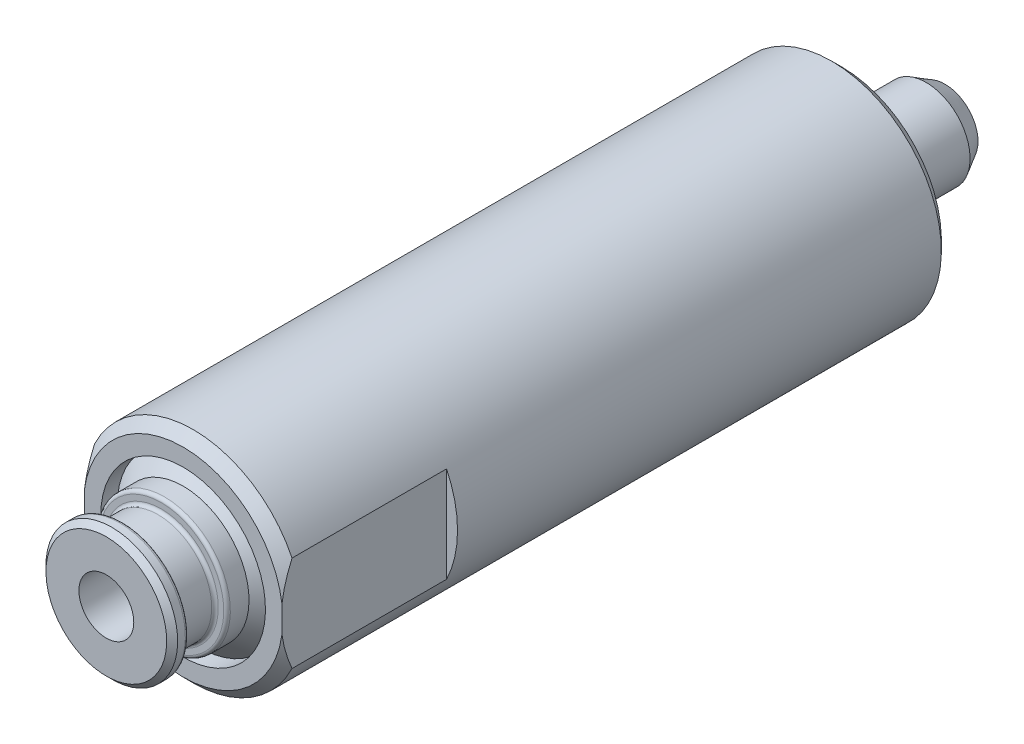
ISO-10303-21;
HEADER;
FILE_DESCRIPTION(('STEP AP214'),'2;1');
FILE_NAME('part.step','',(''),(''),'','','');
FILE_SCHEMA(('AUTOMOTIVE_DESIGN { 1 0 10303 214 1 1 1 1 }'));
ENDSEC;
DATA;
#1=APPLICATION_CONTEXT('core data for automotive mechanical design processes');
#2=APPLICATION_PROTOCOL_DEFINITION('international standard','automotive_design',2000,#1);
#3=PRODUCT_CONTEXT('',#1,'mechanical');
#4=PRODUCT('Part','Part','',(#3));
#5=PRODUCT_RELATED_PRODUCT_CATEGORY('part','',(#4));
#6=PRODUCT_DEFINITION_FORMATION('','',#4);
#7=PRODUCT_DEFINITION_CONTEXT('part definition',#1,'design');
#8=PRODUCT_DEFINITION('design','',#6,#7);
#9=PRODUCT_DEFINITION_SHAPE('','',#8);
#10=(LENGTH_UNIT() NAMED_UNIT(*) SI_UNIT(.MILLI.,.METRE.));
#11=(NAMED_UNIT(*) PLANE_ANGLE_UNIT() SI_UNIT($,.RADIAN.));
#12=(NAMED_UNIT(*) SI_UNIT($,.STERADIAN.) SOLID_ANGLE_UNIT());
#13=UNCERTAINTY_MEASURE_WITH_UNIT(LENGTH_MEASURE(1.E-05),#10,'distance_accuracy_value','');
#14=(GEOMETRIC_REPRESENTATION_CONTEXT(3) GLOBAL_UNCERTAINTY_ASSIGNED_CONTEXT((#13)) GLOBAL_UNIT_ASSIGNED_CONTEXT((#10,
#11,#12)) REPRESENTATION_CONTEXT('',''));
#15=CARTESIAN_POINT('',(0.,0.,0.));
#16=DIRECTION('',(0.,0.,1.));
#17=DIRECTION('',(1.,0.,0.));
#18=AXIS2_PLACEMENT_3D('',#15,#16,#17);
#19=CARTESIAN_POINT('',(0.,0.,-2.));
#20=DIRECTION('',(0.,0.,-1.));
#21=DIRECTION('',(-1.,0.,0.));
#22=AXIS2_PLACEMENT_3D('',#19,#20,#21);
#23=SPHERICAL_SURFACE('',#22,8.);
#24=CARTESIAN_POINT('',(0.,0.,-9.41135340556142));
#25=DIRECTION('',(0.,0.,-1.));
#26=DIRECTION('',(0.,1.,0.));
#27=AXIS2_PLACEMENT_3D('',#24,#25,#26);
#28=CIRCLE('',#27,3.01194965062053);
#29=CARTESIAN_POINT('',(0.,3.01194965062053,-9.41135340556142));
#30=VERTEX_POINT('',#29);
#31=EDGE_CURVE('E9',#30,#30,#28,.T.);
#32=ORIENTED_EDGE('',*,*,#31,.T.);
#33=EDGE_LOOP('',(#32));
#34=FACE_BOUND('',#33,.T.);
#35=ADVANCED_FACE('F14',(#34),#23,.T.);
#36=CARTESIAN_POINT('',(0.,0.,-7.7));
#37=DIRECTION('',(0.,0.,1.));
#38=DIRECTION('',(0.,-1.,0.));
#39=AXIS2_PLACEMENT_3D('',#36,#37,#38);
#40=CONICAL_SURFACE('',#39,4.,0.523598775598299);
#41=ORIENTED_EDGE('',*,*,#31,.F.);
#42=EDGE_LOOP('',(#41));
#43=FACE_BOUND('',#42,.T.);
#44=CARTESIAN_POINT('',(0.,0.,-7.7));
#45=DIRECTION('',(0.,0.,1.));
#46=DIRECTION('',(0.,-1.,0.));
#47=AXIS2_PLACEMENT_3D('',#44,#45,#46);
#48=CIRCLE('',#47,4.);
#49=CARTESIAN_POINT('',(0.,-4.,-7.7));
#50=VERTEX_POINT('',#49);
#51=EDGE_CURVE('E108',#50,#50,#48,.T.);
#52=ORIENTED_EDGE('',*,*,#51,.F.);
#53=EDGE_LOOP('',(#52));
#54=FACE_BOUND('',#53,.T.);
#55=ADVANCED_FACE('F232',(#43,#54),#40,.T.);
#56=CARTESIAN_POINT('',(0.,0.,0.));
#57=DIRECTION('',(0.,0.,-1.));
#58=DIRECTION('',(0.,1.,0.));
#59=AXIS2_PLACEMENT_3D('',#56,#57,#58);
#60=CYLINDRICAL_SURFACE('',#59,4.);
#61=CARTESIAN_POINT('',(0.,0.,0.));
#62=DIRECTION('',(0.,0.,1.));
#63=DIRECTION('',(0.,-1.,0.));
#64=AXIS2_PLACEMENT_3D('',#61,#62,#63);
#65=CIRCLE('',#64,4.);
#66=CARTESIAN_POINT('',(0.,-4.,0.));
#67=VERTEX_POINT('',#66);
#68=EDGE_CURVE('E23',#67,#67,#65,.T.);
#69=ORIENTED_EDGE('',*,*,#68,.F.);
#70=EDGE_LOOP('',(#69));
#71=FACE_BOUND('',#70,.T.);
#72=ORIENTED_EDGE('',*,*,#51,.T.);
#73=EDGE_LOOP('',(#72));
#74=FACE_BOUND('',#73,.T.);
#75=ADVANCED_FACE('F221',(#71,#74),#60,.T.);
#76=CARTESIAN_POINT('',(2.067,0.,67.));
#77=DIRECTION('',(0.,0.,-1.));
#78=DIRECTION('',(0.,1.,0.));
#79=AXIS2_PLACEMENT_3D('',#76,#77,#78);
#80=PLANE('',#79);
#81=CARTESIAN_POINT('',(0.,0.,67.));
#82=DIRECTION('',(0.,0.,1.));
#83=DIRECTION('',(1.,0.,0.));
#84=AXIS2_PLACEMENT_3D('',#81,#82,#83);
#85=CIRCLE('',#84,2.5);
#86=CARTESIAN_POINT('',(2.5,0.,67.));
#87=VERTEX_POINT('',#86);
#88=EDGE_CURVE('E251',#87,#87,#85,.T.);
#89=ORIENTED_EDGE('',*,*,#88,.F.);
#90=EDGE_LOOP('',(#89));
#91=FACE_BOUND('',#90,.T.);
#92=CARTESIAN_POINT('',(0.,0.,67.));
#93=DIRECTION('',(0.,0.,-1.));
#94=DIRECTION('',(0.,1.,0.));
#95=AXIS2_PLACEMENT_3D('',#92,#93,#94);
#96=CIRCLE('',#95,5.5);
#97=CARTESIAN_POINT('',(0.,5.5,67.));
#98=VERTEX_POINT('',#97);
#99=EDGE_CURVE('E153',#98,#98,#96,.T.);
#100=ORIENTED_EDGE('',*,*,#99,.F.);
#101=EDGE_LOOP('',(#100));
#102=FACE_BOUND('',#101,.T.);
#103=ADVANCED_FACE('F211',(#91,#102),#80,.F.);
#104=CARTESIAN_POINT('',(0.,0.,67.));
#105=DIRECTION('',(0.,0.,-1.));
#106=DIRECTION('',(0.,1.,0.));
#107=AXIS2_PLACEMENT_3D('',#104,#105,#106);
#108=CONICAL_SURFACE('',#107,5.5,0.785398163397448);
#109=CARTESIAN_POINT('',(0.,0.,66.5));
#110=DIRECTION('',(0.,0.,-1.));
#111=DIRECTION('',(0.,1.,0.));
#112=AXIS2_PLACEMENT_3D('',#109,#110,#111);
#113=CIRCLE('',#112,6.);
#114=CARTESIAN_POINT('',(0.,6.,66.5));
#115=VERTEX_POINT('',#114);
#116=EDGE_CURVE('E150',#115,#115,#113,.T.);
#117=ORIENTED_EDGE('',*,*,#116,.F.);
#118=EDGE_LOOP('',(#117));
#119=FACE_BOUND('',#118,.T.);
#120=ORIENTED_EDGE('',*,*,#99,.T.);
#121=EDGE_LOOP('',(#120));
#122=FACE_BOUND('',#121,.T.);
#123=ADVANCED_FACE('F220',(#119,#122),#108,.T.);
#124=CARTESIAN_POINT('',(0.,0.,44.5));
#125=DIRECTION('',(0.,0.,-1.));
#126=DIRECTION('',(0.,1.,0.));
#127=AXIS2_PLACEMENT_3D('',#124,#125,#126);
#128=CYLINDRICAL_SURFACE('',#127,6.);
#129=CARTESIAN_POINT('',(0.,0.,65.8));
#130=DIRECTION('',(0.,0.,-1.));
#131=DIRECTION('',(0.,1.,0.));
#132=AXIS2_PLACEMENT_3D('',#129,#130,#131);
#133=CIRCLE('',#132,6.);
#134=CARTESIAN_POINT('',(0.,6.,65.8));
#135=VERTEX_POINT('',#134);
#136=EDGE_CURVE('E147',#135,#135,#133,.T.);
#137=ORIENTED_EDGE('',*,*,#136,.F.);
#138=EDGE_LOOP('',(#137));
#139=FACE_BOUND('',#138,.T.);
#140=ORIENTED_EDGE('',*,*,#116,.T.);
#141=EDGE_LOOP('',(#140));
#142=FACE_BOUND('',#141,.T.);
#143=ADVANCED_FACE('F229',(#139,#142),#128,.T.);
#144=CARTESIAN_POINT('',(0.,0.,65.8));
#145=DIRECTION('',(0.,0.,-1.));
#146=DIRECTION('',(0.,1.,0.));
#147=AXIS2_PLACEMENT_3D('',#144,#145,#146);
#148=TOROIDAL_SURFACE('',#147,5.7,0.300000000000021);
#149=ORIENTED_EDGE('',*,*,#136,.T.);
#150=EDGE_LOOP('',(#149));
#151=FACE_BOUND('',#150,.T.);
#152=CARTESIAN_POINT('',(0.,0.,65.5));
#153=DIRECTION('',(0.,0.,-1.));
#154=DIRECTION('',(0.,1.,0.));
#155=AXIS2_PLACEMENT_3D('',#152,#153,#154);
#156=CIRCLE('',#155,5.7);
#157=CARTESIAN_POINT('',(0.,5.7,65.5));
#158=VERTEX_POINT('',#157);
#159=EDGE_CURVE('E144',#158,#158,#156,.T.);
#160=ORIENTED_EDGE('',*,*,#159,.F.);
#161=EDGE_LOOP('',(#160));
#162=FACE_BOUND('',#161,.T.);
#163=ADVANCED_FACE('F297',(#151,#162),#148,.T.);
#164=CARTESIAN_POINT('',(5.7,0.,65.5));
#165=DIRECTION('',(0.,0.,1.));
#166=DIRECTION('',(0.,-1.,0.));
#167=AXIS2_PLACEMENT_3D('',#164,#165,#166);
#168=PLANE('',#167);
#169=CARTESIAN_POINT('',(0.,0.,65.5));
#170=DIRECTION('',(0.,0.,-1.));
#171=DIRECTION('',(0.,1.,0.));
#172=AXIS2_PLACEMENT_3D('',#169,#170,#171);
#173=CIRCLE('',#172,5.2);
#174=CARTESIAN_POINT('',(0.,5.2,65.5));
#175=VERTEX_POINT('',#174);
#176=EDGE_CURVE('E141',#175,#175,#173,.T.);
#177=ORIENTED_EDGE('',*,*,#176,.F.);
#178=EDGE_LOOP('',(#177));
#179=FACE_BOUND('',#178,.T.);
#180=ORIENTED_EDGE('',*,*,#159,.T.);
#181=EDGE_LOOP('',(#180));
#182=FACE_BOUND('',#181,.T.);
#183=ADVANCED_FACE('F293',(#179,#182),#168,.F.);
#184=CARTESIAN_POINT('',(0.,0.,65.2));
#185=DIRECTION('',(0.,0.,-1.));
#186=DIRECTION('',(0.,1.,0.));
#187=AXIS2_PLACEMENT_3D('',#184,#185,#186);
#188=TOROIDAL_SURFACE('',#187,5.2,0.300000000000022);
#189=CARTESIAN_POINT('',(0.,0.,65.2));
#190=DIRECTION('',(0.,0.,-1.));
#191=DIRECTION('',(0.,1.,0.));
#192=AXIS2_PLACEMENT_3D('',#189,#190,#191);
#193=CIRCLE('',#192,4.9);
#194=CARTESIAN_POINT('',(0.,4.9,65.2));
#195=VERTEX_POINT('',#194);
#196=EDGE_CURVE('E138',#195,#195,#193,.T.);
#197=ORIENTED_EDGE('',*,*,#196,.F.);
#198=EDGE_LOOP('',(#197));
#199=FACE_BOUND('',#198,.T.);
#200=ORIENTED_EDGE('',*,*,#176,.T.);
#201=EDGE_LOOP('',(#200));
#202=FACE_BOUND('',#201,.T.);
#203=ADVANCED_FACE('F289',(#199,#202),#188,.F.);
#204=CARTESIAN_POINT('',(0.,0.,44.5));
#205=DIRECTION('',(0.,0.,-1.));
#206=DIRECTION('',(0.,1.,0.));
#207=AXIS2_PLACEMENT_3D('',#204,#205,#206);
#208=CYLINDRICAL_SURFACE('',#207,4.9);
#209=CARTESIAN_POINT('',(0.,0.,62.3));
#210=DIRECTION('',(0.,0.,-1.));
#211=DIRECTION('',(0.,1.,0.));
#212=AXIS2_PLACEMENT_3D('',#209,#210,#211);
#213=CIRCLE('',#212,4.9);
#214=CARTESIAN_POINT('',(0.,4.9,62.3));
#215=VERTEX_POINT('',#214);
#216=EDGE_CURVE('E135',#215,#215,#213,.T.);
#217=ORIENTED_EDGE('',*,*,#216,.F.);
#218=EDGE_LOOP('',(#217));
#219=FACE_BOUND('',#218,.T.);
#220=ORIENTED_EDGE('',*,*,#196,.T.);
#221=EDGE_LOOP('',(#220));
#222=FACE_BOUND('',#221,.T.);
#223=ADVANCED_FACE('F285',(#219,#222),#208,.T.);
#224=CARTESIAN_POINT('',(0.,0.,62.3));
#225=DIRECTION('',(0.,0.,-1.));
#226=DIRECTION('',(0.,1.,0.));
#227=AXIS2_PLACEMENT_3D('',#224,#225,#226);
#228=TOROIDAL_SURFACE('',#227,5.2,0.299999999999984);
#229=CARTESIAN_POINT('',(0.,0.,62.));
#230=DIRECTION('',(0.,0.,-1.));
#231=DIRECTION('',(0.,1.,0.));
#232=AXIS2_PLACEMENT_3D('',#229,#230,#231);
#233=CIRCLE('',#232,5.2);
#234=CARTESIAN_POINT('',(0.,5.2,62.));
#235=VERTEX_POINT('',#234);
#236=EDGE_CURVE('E132',#235,#235,#233,.T.);
#237=ORIENTED_EDGE('',*,*,#236,.F.);
#238=EDGE_LOOP('',(#237));
#239=FACE_BOUND('',#238,.T.);
#240=ORIENTED_EDGE('',*,*,#216,.T.);
#241=EDGE_LOOP('',(#240));
#242=FACE_BOUND('',#241,.T.);
#243=ADVANCED_FACE('F281',(#239,#242),#228,.F.);
#244=CARTESIAN_POINT('',(5.2,0.,62.));
#245=DIRECTION('',(0.,0.,-1.));
#246=DIRECTION('',(0.,1.,0.));
#247=AXIS2_PLACEMENT_3D('',#244,#245,#246);
#248=PLANE('',#247);
#249=CARTESIAN_POINT('',(0.,0.,62.));
#250=DIRECTION('',(0.,0.,-1.));
#251=DIRECTION('',(0.,1.,0.));
#252=AXIS2_PLACEMENT_3D('',#249,#250,#251);
#253=CIRCLE('',#252,5.7);
#254=CARTESIAN_POINT('',(0.,5.7,62.));
#255=VERTEX_POINT('',#254);
#256=EDGE_CURVE('E129',#255,#255,#253,.T.);
#257=ORIENTED_EDGE('',*,*,#256,.F.);
#258=EDGE_LOOP('',(#257));
#259=FACE_BOUND('',#258,.T.);
#260=ORIENTED_EDGE('',*,*,#236,.T.);
#261=EDGE_LOOP('',(#260));
#262=FACE_BOUND('',#261,.T.);
#263=ADVANCED_FACE('F277',(#259,#262),#248,.F.);
#264=CARTESIAN_POINT('',(0.,0.,61.7));
#265=DIRECTION('',(0.,0.,-1.));
#266=DIRECTION('',(0.,1.,0.));
#267=AXIS2_PLACEMENT_3D('',#264,#265,#266);
#268=TOROIDAL_SURFACE('',#267,5.7,0.299999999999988);
#269=ORIENTED_EDGE('',*,*,#256,.T.);
#270=EDGE_LOOP('',(#269));
#271=FACE_BOUND('',#270,.T.);
#272=CARTESIAN_POINT('',(0.,0.,61.7));
#273=DIRECTION('',(0.,0.,-1.));
#274=DIRECTION('',(0.,1.,0.));
#275=AXIS2_PLACEMENT_3D('',#272,#273,#274);
#276=CIRCLE('',#275,6.);
#277=CARTESIAN_POINT('',(0.,6.,61.7));
#278=VERTEX_POINT('',#277);
#279=EDGE_CURVE('E126',#278,#278,#276,.T.);
#280=ORIENTED_EDGE('',*,*,#279,.F.);
#281=EDGE_LOOP('',(#280));
#282=FACE_BOUND('',#281,.T.);
#283=ADVANCED_FACE('F273',(#271,#282),#268,.T.);
#284=CARTESIAN_POINT('',(0.,0.,44.5));
#285=DIRECTION('',(0.,0.,-1.));
#286=DIRECTION('',(0.,1.,0.));
#287=AXIS2_PLACEMENT_3D('',#284,#285,#286);
#288=CYLINDRICAL_SURFACE('',#287,6.);
#289=CARTESIAN_POINT('',(0.,0.,60.));
#290=DIRECTION('',(0.,0.,-1.));
#291=DIRECTION('',(0.,1.,0.));
#292=AXIS2_PLACEMENT_3D('',#289,#290,#291);
#293=CIRCLE('',#292,6.);
#294=CARTESIAN_POINT('',(0.,6.,60.));
#295=VERTEX_POINT('',#294);
#296=EDGE_CURVE('E122',#295,#295,#293,.T.);
#297=ORIENTED_EDGE('',*,*,#296,.F.);
#298=EDGE_LOOP('',(#297));
#299=FACE_BOUND('',#298,.T.);
#300=ORIENTED_EDGE('',*,*,#279,.T.);
#301=EDGE_LOOP('',(#300));
#302=FACE_BOUND('',#301,.T.);
#303=ADVANCED_FACE('F269',(#299,#302),#288,.T.);
#304=CARTESIAN_POINT('',(0.,0.,60.));
#305=DIRECTION('',(0.,0.,-1.));
#306=DIRECTION('',(0.,1.,0.));
#307=AXIS2_PLACEMENT_3D('',#304,#305,#306);
#308=CONICAL_SURFACE('',#307,6.,0.78539816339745);
#309=CARTESIAN_POINT('',(0.,0.,58.5));
#310=DIRECTION('',(0.,0.,-1.));
#311=DIRECTION('',(0.,1.,0.));
#312=AXIS2_PLACEMENT_3D('',#309,#310,#311);
#313=CIRCLE('',#312,7.5);
#314=CARTESIAN_POINT('',(0.,7.5,58.5));
#315=VERTEX_POINT('',#314);
#316=EDGE_CURVE('E119',#315,#315,#313,.T.);
#317=ORIENTED_EDGE('',*,*,#316,.F.);
#318=EDGE_LOOP('',(#317));
#319=FACE_BOUND('',#318,.T.);
#320=ORIENTED_EDGE('',*,*,#296,.T.);
#321=EDGE_LOOP('',(#320));
#322=FACE_BOUND('',#321,.T.);
#323=ADVANCED_FACE('F183',(#319,#322),#308,.T.);
#324=CARTESIAN_POINT('',(0.,0.,0.));
#325=DIRECTION('',(0.,0.,-1.));
#326=DIRECTION('',(0.,1.,0.));
#327=AXIS2_PLACEMENT_3D('',#324,#325,#326);
#328=CYLINDRICAL_SURFACE('',#327,7.5);
#329=ORIENTED_EDGE('',*,*,#316,.T.);
#330=EDGE_LOOP('',(#329));
#331=FACE_BOUND('',#330,.T.);
#332=CARTESIAN_POINT('',(0.,0.,60.));
#333=DIRECTION('',(0.,0.,-1.));
#334=DIRECTION('',(0.,1.,0.));
#335=AXIS2_PLACEMENT_3D('',#332,#333,#334);
#336=CIRCLE('',#335,7.5);
#337=CARTESIAN_POINT('',(0.,7.5,60.));
#338=VERTEX_POINT('',#337);
#339=EDGE_CURVE('E95',#338,#338,#336,.T.);
#340=ORIENTED_EDGE('',*,*,#339,.F.);
#341=EDGE_LOOP('',(#340));
#342=FACE_BOUND('',#341,.T.);
#343=ADVANCED_FACE('F181',(#331,#342),#328,.F.);
#344=CARTESIAN_POINT('',(9.08,0.,60.));
#345=DIRECTION('',(0.,0.,1.));
#346=DIRECTION('',(0.,-1.,0.));
#347=AXIS2_PLACEMENT_3D('',#344,#345,#346);
#348=PLANE('',#347);
#349=ORIENTED_EDGE('',*,*,#339,.T.);
#350=EDGE_LOOP('',(#349));
#351=FACE_BOUND('',#350,.T.);
#352=CARTESIAN_POINT('',(0.,0.,60.));
#353=DIRECTION('',(0.,0.,-1.));
#354=DIRECTION('',(0.,1.,0.));
#355=AXIS2_PLACEMENT_3D('',#352,#353,#354);
#356=CIRCLE('',#355,9.08);
#357=CARTESIAN_POINT('',(-9.,1.20266371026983,60.));
#358=VERTEX_POINT('',#357);
#359=CARTESIAN_POINT('',(9.,1.20266371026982,60.));
#360=VERTEX_POINT('',#359);
#361=EDGE_CURVE('E92',#358,#360,#356,.T.);
#362=ORIENTED_EDGE('',*,*,#361,.F.);
#363=DIRECTION('',(0.,-1.,0.));
#364=VECTOR('',#363,1.);
#365=CARTESIAN_POINT('',(-9.,0.,60.));
#366=LINE('',#365,#364);
#367=CARTESIAN_POINT('',(-9.,-1.20266371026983,60.));
#368=VERTEX_POINT('',#367);
#369=EDGE_CURVE('E78',#358,#368,#366,.T.);
#370=ORIENTED_EDGE('',*,*,#369,.T.);
#371=CARTESIAN_POINT('',(9.,-1.20266371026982,60.));
#372=VERTEX_POINT('',#371);
#373=EDGE_CURVE('E85',#372,#368,#356,.T.);
#374=ORIENTED_EDGE('',*,*,#373,.F.);
#375=DIRECTION('',(0.,1.,0.));
#376=VECTOR('',#375,1.);
#377=CARTESIAN_POINT('',(9.,0.,60.));
#378=LINE('',#377,#376);
#379=EDGE_CURVE('E68',#372,#360,#378,.T.);
#380=ORIENTED_EDGE('',*,*,#379,.T.);
#381=EDGE_LOOP('',(#362,#370,#374,#380));
#382=FACE_BOUND('',#381,.T.);
#383=ADVANCED_FACE('F90',(#351,#382),#348,.T.);
#384=CARTESIAN_POINT('',(0.,0.,59.08));
#385=DIRECTION('',(0.,0.,-1.));
#386=DIRECTION('',(0.,1.,0.));
#387=AXIS2_PLACEMENT_3D('',#384,#385,#386);
#388=CONICAL_SURFACE('',#387,10.,0.78539816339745);
#389=CARTESIAN_POINT('',(0.,0.,59.08));
#390=DIRECTION('',(0.,0.,-1.));
#391=DIRECTION('',(0.,1.,0.));
#392=AXIS2_PLACEMENT_3D('',#389,#390,#391);
#393=CIRCLE('',#392,10.);
#394=CARTESIAN_POINT('',(-9.,4.35889894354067,59.08));
#395=VERTEX_POINT('',#394);
#396=CARTESIAN_POINT('',(9.,4.35889894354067,59.08));
#397=VERTEX_POINT('',#396);
#398=EDGE_CURVE('E91',#395,#397,#393,.T.);
#399=ORIENTED_EDGE('',*,*,#398,.F.);
#400=CARTESIAN_POINT('',(-9.,20.0889844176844,47.0671107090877));
#401=CARTESIAN_POINT('',(-9.,19.7941845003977,47.3361376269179));
#402=CARTESIAN_POINT('',(-9.,19.4988987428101,47.6046332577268));
#403=CARTESIAN_POINT('',(-9.,18.9072134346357,48.1403994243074));
#404=CARTESIAN_POINT('',(-9.,18.6108138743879,48.4076699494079));
#405=CARTESIAN_POINT('',(-9.,18.0166892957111,48.9408857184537));
#406=CARTESIAN_POINT('',(-9.,17.7189639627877,49.2068306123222));
#407=CARTESIAN_POINT('',(-9.,17.1220890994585,49.7371142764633));
#408=CARTESIAN_POINT('',(-9.,16.822939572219,50.0014530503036));
#409=CARTESIAN_POINT('',(-9.,15.9186985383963,50.7955547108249));
#410=CARTESIAN_POINT('',(-9.,15.3111326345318,51.3225158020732));
#411=CARTESIAN_POINT('',(-9.,14.3932925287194,52.1052669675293));
#412=CARTESIAN_POINT('',(-9.,14.0862824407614,52.3648870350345));
#413=CARTESIAN_POINT('',(-9.,13.4697157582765,52.8810880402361));
#414=CARTESIAN_POINT('',(-9.,13.1601591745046,53.137668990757));
#415=CARTESIAN_POINT('',(-9.,12.5849192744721,53.6088254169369));
#416=CARTESIAN_POINT('',(-9.,12.3196505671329,53.8239068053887));
#417=CARTESIAN_POINT('',(-9.,11.7866455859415,54.2509886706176));
#418=CARTESIAN_POINT('',(-9.,11.5189093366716,54.4629891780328));
#419=CARTESIAN_POINT('',(-9.,10.9804995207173,54.883413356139));
#420=CARTESIAN_POINT('',(-9.,10.7098250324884,55.0918358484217));
#421=CARTESIAN_POINT('',(-9.,10.1651714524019,55.5043204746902));
#422=CARTESIAN_POINT('',(-9.,9.89119239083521,55.7083826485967));
#423=CARTESIAN_POINT('',(-9.,9.33978293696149,56.1109565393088));
#424=CARTESIAN_POINT('',(-9.,9.06235809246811,56.3094758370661));
#425=CARTESIAN_POINT('',(-9.,8.50301529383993,56.7001296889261));
#426=CARTESIAN_POINT('',(-9.,8.22109712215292,56.8922639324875));
#427=CARTESIAN_POINT('',(-9.,7.65217834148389,57.2685512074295));
#428=CARTESIAN_POINT('',(-9.,7.36518050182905,57.4527084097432));
#429=CARTESIAN_POINT('',(-9.,6.78513344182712,57.8111918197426));
#430=CARTESIAN_POINT('',(-9.,6.49208508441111,57.9855194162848));
#431=CARTESIAN_POINT('',(-9.,5.90679788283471,58.317393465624));
#432=CARTESIAN_POINT('',(-9.,5.61474269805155,58.4752618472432));
#433=CARTESIAN_POINT('',(-9.,5.02305416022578,58.7763015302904));
#434=CARTESIAN_POINT('',(-9.,4.72342010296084,58.9194714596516));
#435=CARTESIAN_POINT('',(-9.,4.11636189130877,59.1870563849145));
#436=CARTESIAN_POINT('',(-9.,3.80895049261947,59.3115000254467));
#437=CARTESIAN_POINT('',(-9.,3.18569208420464,59.5372331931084));
#438=CARTESIAN_POINT('',(-9.,2.86984745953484,59.6385291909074));
#439=CARTESIAN_POINT('',(-9.,2.29142781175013,59.7962123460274));
#440=CARTESIAN_POINT('',(-9.,2.03019136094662,59.8574808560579));
#441=CARTESIAN_POINT('',(-9.,1.5036267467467,59.958913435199));
#442=CARTESIAN_POINT('',(-9.,1.23829917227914,59.9990805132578));
#443=CARTESIAN_POINT('',(-9.,0.705706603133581,60.0562472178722));
#444=CARTESIAN_POINT('',(-9.,0.438447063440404,60.0732969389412));
#445=CARTESIAN_POINT('',(-9.,-0.0965355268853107,60.0834560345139));
#446=CARTESIAN_POINT('',(-9.,-0.364258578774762,60.076565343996));
#447=CARTESIAN_POINT('',(-9.,-0.89754729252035,60.0392623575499));
#448=CARTESIAN_POINT('',(-9.,-1.1631159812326,60.0088926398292));
#449=CARTESIAN_POINT('',(-9.,-1.69079838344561,59.9262664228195));
#450=CARTESIAN_POINT('',(-9.,-1.95291180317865,59.8740080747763));
#451=CARTESIAN_POINT('',(-9.,-2.47314253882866,59.7498122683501));
#452=CARTESIAN_POINT('',(-9.,-2.73124679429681,59.6778207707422));
#453=CARTESIAN_POINT('',(-9.,-3.24205693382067,59.516938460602));
#454=CARTESIAN_POINT('',(-9.,-3.49476303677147,59.4280483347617));
#455=CARTESIAN_POINT('',(-9.,-4.07604409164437,59.2047542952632));
#456=CARTESIAN_POINT('',(-9.,-4.40253716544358,59.0649539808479));
#457=CARTESIAN_POINT('',(-9.,-5.0464515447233,58.7656734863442));
#458=CARTESIAN_POINT('',(-9.,-5.36386785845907,58.6061827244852));
#459=CARTESIAN_POINT('',(-9.,-5.99110227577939,58.2715395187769));
#460=CARTESIAN_POINT('',(-9.,-6.30090358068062,58.0963558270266));
#461=CARTESIAN_POINT('',(-9.,-6.91327229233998,57.7339678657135));
#462=CARTESIAN_POINT('',(-9.,-7.21584094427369,57.5467656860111));
#463=CARTESIAN_POINT('',(-9.,-7.81811190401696,57.160734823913));
#464=CARTESIAN_POINT('',(-9.,-8.11774682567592,56.9618014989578));
#465=CARTESIAN_POINT('',(-9.,-8.71169811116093,56.5561568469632));
#466=CARTESIAN_POINT('',(-9.,-9.00601430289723,56.3494452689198));
#467=CARTESIAN_POINT('',(-9.,-9.58977868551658,55.9299922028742));
#468=CARTESIAN_POINT('',(-9.,-9.87923221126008,55.717258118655));
#469=CARTESIAN_POINT('',(-9.,-10.4543036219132,55.2866619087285));
#470=CARTESIAN_POINT('',(-9.,-10.7399213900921,55.0687996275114));
#471=CARTESIAN_POINT('',(-9.,-11.4242974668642,54.5386678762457));
#472=CARTESIAN_POINT('',(-9.,-11.8214368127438,54.2243100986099));
#473=CARTESIAN_POINT('',(-9.,-12.6104586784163,53.5890670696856));
#474=CARTESIAN_POINT('',(-9.,-13.0023410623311,53.2681816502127));
#475=CARTESIAN_POINT('',(-9.,-13.7819938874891,52.6210793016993));
#476=CARTESIAN_POINT('',(-9.,-14.1697622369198,52.2948598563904));
#477=CARTESIAN_POINT('',(-9.,-14.9417496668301,51.6382482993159));
#478=CARTESIAN_POINT('',(-9.,-15.3259687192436,51.3078561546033));
#479=CARTESIAN_POINT('',(-9.,-16.0783900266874,50.6549933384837));
#480=CARTESIAN_POINT('',(-9.,-16.44669153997,50.3326369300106));
#481=CARTESIAN_POINT('',(-9.,-17.1809601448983,49.6852740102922));
#482=CARTESIAN_POINT('',(-9.,-17.5469272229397,49.3602674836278));
#483=CARTESIAN_POINT('',(-9.,-18.276556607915,48.7083120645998));
#484=CARTESIAN_POINT('',(-9.,-18.640220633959,48.3813650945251));
#485=CARTESIAN_POINT('',(-9.,-19.3658255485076,47.725578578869));
#486=CARTESIAN_POINT('',(-9.,-19.727766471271,47.3967390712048));
#487=CARTESIAN_POINT('',(-9.,-20.0889844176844,47.0671107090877));
#488=B_SPLINE_CURVE_WITH_KNOTS('',3,(#400,#401,#402,#403,#404,#405,#406,#407,#408,#409,#410,
#411,#412,#413,#414,#415,#416,#417,#418,#419,#420,#421,#422,#423,#424,#425,#426,#427,#428,#429,
#430,#431,#432,#433,#434,#435,#436,#437,#438,#439,#440,#441,#442,#443,#444,#445,#446,#447,#448,
#449,#450,#451,#452,#453,#454,#455,#456,#457,#458,#459,#460,#461,#462,#463,#464,#465,#466,#467,
#468,#469,#470,#471,#472,#473,#474,#475,#476,#477,#478,#479,#480,#481,#482,#483,#484,#485,#486,
#487),.UNSPECIFIED.,.F.,.F.,(4,2,2,2,2,2,2,2,2,2,2,2,2,2,2,2,2,2,2,2,2,2,2,2,2,2,2,2,2,2,2,2,2,
2,2,2,2,2,2,2,2,2,2,4),(0.,1.19730659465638,2.39462359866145,3.59224161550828,4.78985697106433,
7.20251667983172,8.40870278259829,9.61488379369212,10.639387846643,11.663881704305,
12.6887067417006,13.7135223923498,14.7368599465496,15.7602471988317,16.7830927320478,
17.8057933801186,18.8014398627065,19.7971792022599,20.7913795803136,21.7853016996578,
22.5895213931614,23.3936263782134,24.1959860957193,24.9983479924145,25.7992582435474,
26.6002361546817,27.4034298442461,28.206590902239,29.2712072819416,30.3363983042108,
31.4037596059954,32.47093580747,33.5497661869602,34.6286314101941,35.70622346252,
36.7838482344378,38.303247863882,39.8226866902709,41.3428642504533,42.8630538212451,
44.3313839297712,45.7997225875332,47.2667917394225,48.7338316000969),.UNSPECIFIED.);
#489=EDGE_CURVE('E198',#395,#358,#488,.T.);
#490=ORIENTED_EDGE('',*,*,#489,.T.);
#491=ORIENTED_EDGE('',*,*,#361,.T.);
#492=CARTESIAN_POINT('',(9.,-20.0889844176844,47.0671107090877));
#493=CARTESIAN_POINT('',(9.,-19.7941845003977,47.3361376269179));
#494=CARTESIAN_POINT('',(9.,-19.4988987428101,47.6046332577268));
#495=CARTESIAN_POINT('',(9.,-18.9072134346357,48.1403994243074));
#496=CARTESIAN_POINT('',(9.,-18.6108138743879,48.4076699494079));
#497=CARTESIAN_POINT('',(9.,-18.0166892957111,48.9408857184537));
#498=CARTESIAN_POINT('',(9.,-17.7189639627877,49.2068306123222));
#499=CARTESIAN_POINT('',(9.,-17.1220890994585,49.7371142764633));
#500=CARTESIAN_POINT('',(9.,-16.822939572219,50.0014530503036));
#501=CARTESIAN_POINT('',(9.,-15.9186985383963,50.7955547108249));
#502=CARTESIAN_POINT('',(9.,-15.3111326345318,51.3225158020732));
#503=CARTESIAN_POINT('',(9.,-14.3932925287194,52.1052669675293));
#504=CARTESIAN_POINT('',(9.,-14.0862824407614,52.3648870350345));
#505=CARTESIAN_POINT('',(9.,-13.4697157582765,52.8810880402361));
#506=CARTESIAN_POINT('',(9.,-13.1601591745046,53.137668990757));
#507=CARTESIAN_POINT('',(9.,-12.5849192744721,53.6088254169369));
#508=CARTESIAN_POINT('',(9.,-12.3196505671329,53.8239068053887));
#509=CARTESIAN_POINT('',(9.,-11.7866455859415,54.2509886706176));
#510=CARTESIAN_POINT('',(9.,-11.5189093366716,54.4629891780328));
#511=CARTESIAN_POINT('',(9.,-10.9804995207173,54.883413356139));
#512=CARTESIAN_POINT('',(9.,-10.7098250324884,55.0918358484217));
#513=CARTESIAN_POINT('',(9.,-10.1651714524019,55.5043204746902));
#514=CARTESIAN_POINT('',(9.,-9.89119239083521,55.7083826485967));
#515=CARTESIAN_POINT('',(9.,-9.33978293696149,56.1109565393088));
#516=CARTESIAN_POINT('',(9.,-9.06235809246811,56.3094758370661));
#517=CARTESIAN_POINT('',(9.,-8.50301529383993,56.7001296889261));
#518=CARTESIAN_POINT('',(9.,-8.22109712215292,56.8922639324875));
#519=CARTESIAN_POINT('',(9.,-7.65217834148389,57.2685512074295));
#520=CARTESIAN_POINT('',(9.,-7.36518050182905,57.4527084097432));
#521=CARTESIAN_POINT('',(9.,-6.78513344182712,57.8111918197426));
#522=CARTESIAN_POINT('',(9.,-6.49208508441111,57.9855194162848));
#523=CARTESIAN_POINT('',(9.,-5.90679788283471,58.317393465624));
#524=CARTESIAN_POINT('',(9.,-5.61474269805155,58.4752618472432));
#525=CARTESIAN_POINT('',(9.,-5.02305416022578,58.7763015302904));
#526=CARTESIAN_POINT('',(9.,-4.72342010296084,58.9194714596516));
#527=CARTESIAN_POINT('',(9.,-4.11636189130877,59.1870563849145));
#528=CARTESIAN_POINT('',(9.,-3.80895049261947,59.3115000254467));
#529=CARTESIAN_POINT('',(9.,-3.18569208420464,59.5372331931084));
#530=CARTESIAN_POINT('',(9.,-2.86984745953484,59.6385291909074));
#531=CARTESIAN_POINT('',(9.,-2.29142781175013,59.7962123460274));
#532=CARTESIAN_POINT('',(9.,-2.03019136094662,59.8574808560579));
#533=CARTESIAN_POINT('',(9.,-1.5036267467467,59.958913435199));
#534=CARTESIAN_POINT('',(9.,-1.23829917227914,59.9990805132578));
#535=CARTESIAN_POINT('',(9.,-0.705706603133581,60.0562472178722));
#536=CARTESIAN_POINT('',(9.,-0.438447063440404,60.0732969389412));
#537=CARTESIAN_POINT('',(9.,0.0965355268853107,60.0834560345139));
#538=CARTESIAN_POINT('',(9.,0.364258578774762,60.076565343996));
#539=CARTESIAN_POINT('',(9.,0.89754729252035,60.0392623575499));
#540=CARTESIAN_POINT('',(9.,1.1631159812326,60.0088926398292));
#541=CARTESIAN_POINT('',(9.,1.69079838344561,59.9262664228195));
#542=CARTESIAN_POINT('',(9.,1.95291180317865,59.8740080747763));
#543=CARTESIAN_POINT('',(9.,2.47314253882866,59.7498122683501));
#544=CARTESIAN_POINT('',(9.,2.73124679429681,59.6778207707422));
#545=CARTESIAN_POINT('',(9.,3.24205693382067,59.516938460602));
#546=CARTESIAN_POINT('',(9.,3.49476303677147,59.4280483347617));
#547=CARTESIAN_POINT('',(9.,4.07604409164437,59.2047542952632));
#548=CARTESIAN_POINT('',(9.,4.40253716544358,59.0649539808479));
#549=CARTESIAN_POINT('',(9.,5.0464515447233,58.7656734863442));
#550=CARTESIAN_POINT('',(9.,5.36386785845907,58.6061827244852));
#551=CARTESIAN_POINT('',(9.,5.99110227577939,58.2715395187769));
#552=CARTESIAN_POINT('',(9.,6.30090358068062,58.0963558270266));
#553=CARTESIAN_POINT('',(9.,6.91327229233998,57.7339678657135));
#554=CARTESIAN_POINT('',(9.,7.21584094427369,57.5467656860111));
#555=CARTESIAN_POINT('',(9.,7.81811190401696,57.160734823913));
#556=CARTESIAN_POINT('',(9.,8.11774682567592,56.9618014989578));
#557=CARTESIAN_POINT('',(9.,8.71169811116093,56.5561568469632));
#558=CARTESIAN_POINT('',(9.,9.00601430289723,56.3494452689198));
#559=CARTESIAN_POINT('',(9.,9.58977868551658,55.9299922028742));
#560=CARTESIAN_POINT('',(9.,9.87923221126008,55.717258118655));
#561=CARTESIAN_POINT('',(9.,10.4543036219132,55.2866619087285));
#562=CARTESIAN_POINT('',(9.,10.7399213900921,55.0687996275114));
#563=CARTESIAN_POINT('',(9.,11.4242974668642,54.5386678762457));
#564=CARTESIAN_POINT('',(9.,11.8214368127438,54.2243100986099));
#565=CARTESIAN_POINT('',(9.,12.6104586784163,53.5890670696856));
#566=CARTESIAN_POINT('',(9.,13.0023410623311,53.2681816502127));
#567=CARTESIAN_POINT('',(9.,13.7819938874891,52.6210793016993));
#568=CARTESIAN_POINT('',(9.,14.1697622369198,52.2948598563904));
#569=CARTESIAN_POINT('',(9.,14.9417496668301,51.6382482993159));
#570=CARTESIAN_POINT('',(9.,15.3259687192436,51.3078561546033));
#571=CARTESIAN_POINT('',(9.,16.0783900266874,50.6549933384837));
#572=CARTESIAN_POINT('',(9.,16.44669153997,50.3326369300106));
#573=CARTESIAN_POINT('',(9.,17.1809601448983,49.6852740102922));
#574=CARTESIAN_POINT('',(9.,17.5469272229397,49.3602674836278));
#575=CARTESIAN_POINT('',(9.,18.276556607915,48.7083120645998));
#576=CARTESIAN_POINT('',(9.,18.640220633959,48.3813650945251));
#577=CARTESIAN_POINT('',(9.,19.3658255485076,47.725578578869));
#578=CARTESIAN_POINT('',(9.,19.727766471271,47.3967390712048));
#579=CARTESIAN_POINT('',(9.,20.0889844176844,47.0671107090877));
#580=B_SPLINE_CURVE_WITH_KNOTS('',3,(#492,#493,#494,#495,#496,#497,#498,#499,#500,#501,#502,
#503,#504,#505,#506,#507,#508,#509,#510,#511,#512,#513,#514,#515,#516,#517,#518,#519,#520,#521,
#522,#523,#524,#525,#526,#527,#528,#529,#530,#531,#532,#533,#534,#535,#536,#537,#538,#539,#540,
#541,#542,#543,#544,#545,#546,#547,#548,#549,#550,#551,#552,#553,#554,#555,#556,#557,#558,#559,
#560,#561,#562,#563,#564,#565,#566,#567,#568,#569,#570,#571,#572,#573,#574,#575,#576,#577,#578,
#579),.UNSPECIFIED.,.F.,.F.,(4,2,2,2,2,2,2,2,2,2,2,2,2,2,2,2,2,2,2,2,2,2,2,2,2,2,2,2,2,2,2,2,2,
2,2,2,2,2,2,2,2,2,2,4),(0.,1.19730659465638,2.39462359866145,3.59224161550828,4.78985697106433,
7.20251667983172,8.40870278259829,9.61488379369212,10.639387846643,11.663881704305,
12.6887067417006,13.7135223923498,14.7368599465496,15.7602471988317,16.7830927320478,
17.8057933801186,18.8014398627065,19.7971792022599,20.7913795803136,21.7853016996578,
22.5895213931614,23.3936263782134,24.1959860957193,24.9983479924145,25.7992582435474,
26.6002361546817,27.4034298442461,28.206590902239,29.2712072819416,30.3363983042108,
31.4037596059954,32.47093580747,33.5497661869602,34.6286314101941,35.70622346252,
36.7838482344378,38.303247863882,39.8226866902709,41.3428642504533,42.8630538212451,
44.3313839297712,45.7997225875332,47.2667917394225,48.7338316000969),.UNSPECIFIED.);
#581=EDGE_CURVE('E31',#360,#397,#580,.T.);
#582=ORIENTED_EDGE('',*,*,#581,.T.);
#583=EDGE_LOOP('',(#399,#490,#491,#582));
#584=FACE_BOUND('',#583,.T.);
#585=ADVANCED_FACE('F168',(#584),#388,.T.);
#586=CARTESIAN_POINT('',(0.,0.,45.));
#587=DIRECTION('',(0.,0.,1.));
#588=DIRECTION('',(0.,-1.,0.));
#589=AXIS2_PLACEMENT_3D('',#586,#587,#588);
#590=PLANE('',#589);
#591=DIRECTION('',(0.,-1.,0.));
#592=VECTOR('',#591,1.);
#593=CARTESIAN_POINT('',(-9.,10.,45.));
#594=LINE('',#593,#592);
#595=CARTESIAN_POINT('',(-9.,4.35889894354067,45.));
#596=VERTEX_POINT('',#595);
#597=CARTESIAN_POINT('',(-9.,-4.35889894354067,45.));
#598=VERTEX_POINT('',#597);
#599=EDGE_CURVE('E158',#596,#598,#594,.T.);
#600=ORIENTED_EDGE('',*,*,#599,.F.);
#601=CARTESIAN_POINT('',(0.,0.,45.));
#602=DIRECTION('',(0.,0.,1.));
#603=DIRECTION('',(0.,-1.,0.));
#604=AXIS2_PLACEMENT_3D('',#601,#602,#603);
#605=CIRCLE('',#604,10.);
#606=EDGE_CURVE('E104',#598,#596,#605,.F.);
#607=ORIENTED_EDGE('',*,*,#606,.F.);
#608=EDGE_LOOP('',(#600,#607));
#609=FACE_BOUND('',#608,.T.);
#610=ADVANCED_FACE('F192',(#609),#590,.T.);
#611=CARTESIAN_POINT('',(-9.,10.,45.));
#612=DIRECTION('',(-1.,0.,0.));
#613=DIRECTION('',(0.,-1.,0.));
#614=AXIS2_PLACEMENT_3D('',#611,#612,#613);
#615=PLANE('',#614);
#616=ORIENTED_EDGE('',*,*,#599,.T.);
#617=DIRECTION('',(0.,0.,-1.));
#618=VECTOR('',#617,1.);
#619=CARTESIAN_POINT('',(-9.,-4.35889894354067,0.));
#620=LINE('',#619,#618);
#621=CARTESIAN_POINT('',(-9.,-4.35889894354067,59.08));
#622=VERTEX_POINT('',#621);
#623=EDGE_CURVE('E201',#622,#598,#620,.T.);
#624=ORIENTED_EDGE('',*,*,#623,.F.);
#625=EDGE_CURVE('E39',#368,#622,#488,.T.);
#626=ORIENTED_EDGE('',*,*,#625,.F.);
#627=ORIENTED_EDGE('',*,*,#369,.F.);
#628=ORIENTED_EDGE('',*,*,#489,.F.);
#629=DIRECTION('',(0.,0.,-1.));
#630=VECTOR('',#629,1.);
#631=CARTESIAN_POINT('',(-9.,4.35889894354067,0.));
#632=LINE('',#631,#630);
#633=EDGE_CURVE('E197',#596,#395,#632,.F.);
#634=ORIENTED_EDGE('',*,*,#633,.F.);
#635=EDGE_LOOP('',(#616,#624,#626,#627,#628,#634));
#636=FACE_BOUND('',#635,.T.);
#637=ADVANCED_FACE('F178',(#636),#615,.T.);
#638=ORIENTED_EDGE('',*,*,#373,.T.);
#639=ORIENTED_EDGE('',*,*,#625,.T.);
#640=CARTESIAN_POINT('',(9.,-4.35889894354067,59.08));
#641=VERTEX_POINT('',#640);
#642=EDGE_CURVE('E86',#641,#622,#393,.T.);
#643=ORIENTED_EDGE('',*,*,#642,.F.);
#644=EDGE_CURVE('E72',#641,#372,#580,.T.);
#645=ORIENTED_EDGE('',*,*,#644,.T.);
#646=EDGE_LOOP('',(#638,#639,#643,#645));
#647=FACE_BOUND('',#646,.T.);
#648=ADVANCED_FACE('F84',(#647),#388,.T.);
#649=DIRECTION('',(0.,1.,0.));
#650=VECTOR('',#649,1.);
#651=CARTESIAN_POINT('',(9.,-10.,45.));
#652=LINE('',#651,#650);
#653=CARTESIAN_POINT('',(9.,-4.35889894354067,45.));
#654=VERTEX_POINT('',#653);
#655=CARTESIAN_POINT('',(9.,4.35889894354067,45.));
#656=VERTEX_POINT('',#655);
#657=EDGE_CURVE('E156',#654,#656,#652,.T.);
#658=ORIENTED_EDGE('',*,*,#657,.F.);
#659=EDGE_CURVE('E18',#656,#654,#605,.F.);
#660=ORIENTED_EDGE('',*,*,#659,.F.);
#661=EDGE_LOOP('',(#658,#660));
#662=FACE_BOUND('',#661,.T.);
#663=ADVANCED_FACE('F177',(#662),#590,.T.);
#664=CARTESIAN_POINT('',(9.,-10.,45.));
#665=DIRECTION('',(1.,0.,0.));
#666=DIRECTION('',(0.,1.,0.));
#667=AXIS2_PLACEMENT_3D('',#664,#665,#666);
#668=PLANE('',#667);
#669=ORIENTED_EDGE('',*,*,#657,.T.);
#670=DIRECTION('',(0.,0.,-1.));
#671=VECTOR('',#670,1.);
#672=CARTESIAN_POINT('',(9.,4.35889894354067,0.));
#673=LINE('',#672,#671);
#674=EDGE_CURVE('E88',#397,#656,#673,.T.);
#675=ORIENTED_EDGE('',*,*,#674,.F.);
#676=ORIENTED_EDGE('',*,*,#581,.F.);
#677=ORIENTED_EDGE('',*,*,#379,.F.);
#678=ORIENTED_EDGE('',*,*,#644,.F.);
#679=DIRECTION('',(0.,0.,-1.));
#680=VECTOR('',#679,1.);
#681=CARTESIAN_POINT('',(9.,-4.35889894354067,0.));
#682=LINE('',#681,#680);
#683=EDGE_CURVE('E87',#654,#641,#682,.F.);
#684=ORIENTED_EDGE('',*,*,#683,.F.);
#685=EDGE_LOOP('',(#669,#675,#676,#677,#678,#684));
#686=FACE_BOUND('',#685,.T.);
#687=ADVANCED_FACE('F71',(#686),#668,.T.);
#688=CARTESIAN_POINT('',(0.,0.,0.));
#689=DIRECTION('',(0.,0.,-1.));
#690=DIRECTION('',(0.,1.,0.));
#691=AXIS2_PLACEMENT_3D('',#688,#689,#690);
#692=CYLINDRICAL_SURFACE('',#691,10.);
#693=CARTESIAN_POINT('',(0.,0.,0.92));
#694=DIRECTION('',(0.,0.,-1.));
#695=DIRECTION('',(0.,1.,0.));
#696=AXIS2_PLACEMENT_3D('',#693,#694,#695);
#697=CIRCLE('',#696,10.);
#698=CARTESIAN_POINT('',(0.,10.,0.92));
#699=VERTEX_POINT('',#698);
#700=EDGE_CURVE('E99',#699,#699,#697,.T.);
#701=ORIENTED_EDGE('',*,*,#700,.F.);
#702=EDGE_LOOP('',(#701));
#703=FACE_BOUND('',#702,.T.);
#704=ORIENTED_EDGE('',*,*,#674,.T.);
#705=ORIENTED_EDGE('',*,*,#659,.T.);
#706=ORIENTED_EDGE('',*,*,#683,.T.);
#707=ORIENTED_EDGE('',*,*,#642,.T.);
#708=ORIENTED_EDGE('',*,*,#623,.T.);
#709=ORIENTED_EDGE('',*,*,#606,.T.);
#710=ORIENTED_EDGE('',*,*,#633,.T.);
#711=ORIENTED_EDGE('',*,*,#398,.T.);
#712=EDGE_LOOP('',(#704,#705,#706,#707,#708,#709,#710,#711));
#713=FACE_BOUND('',#712,.T.);
#714=ADVANCED_FACE('F176',(#703,#713),#692,.T.);
#715=CARTESIAN_POINT('',(0.,0.,0.));
#716=DIRECTION('',(0.,0.,1.));
#717=DIRECTION('',(0.,-1.,0.));
#718=AXIS2_PLACEMENT_3D('',#715,#716,#717);
#719=CONICAL_SURFACE('',#718,9.08,0.785398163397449);
#720=ORIENTED_EDGE('',*,*,#700,.T.);
#721=EDGE_LOOP('',(#720));
#722=FACE_BOUND('',#721,.T.);
#723=CARTESIAN_POINT('',(0.,0.,0.));
#724=DIRECTION('',(0.,0.,-1.));
#725=DIRECTION('',(0.,1.,0.));
#726=AXIS2_PLACEMENT_3D('',#723,#724,#725);
#727=CIRCLE('',#726,9.08);
#728=CARTESIAN_POINT('',(0.,9.08,0.));
#729=VERTEX_POINT('',#728);
#730=EDGE_CURVE('E79',#729,#729,#727,.T.);
#731=ORIENTED_EDGE('',*,*,#730,.F.);
#732=EDGE_LOOP('',(#731));
#733=FACE_BOUND('',#732,.T.);
#734=ADVANCED_FACE('F258',(#722,#733),#719,.T.);
#735=CARTESIAN_POINT('',(4.,0.,0.));
#736=DIRECTION('',(0.,0.,-1.));
#737=DIRECTION('',(0.,1.,0.));
#738=AXIS2_PLACEMENT_3D('',#735,#736,#737);
#739=PLANE('',#738);
#740=ORIENTED_EDGE('',*,*,#68,.T.);
#741=EDGE_LOOP('',(#740));
#742=FACE_BOUND('',#741,.T.);
#743=ORIENTED_EDGE('',*,*,#730,.T.);
#744=EDGE_LOOP('',(#743));
#745=FACE_BOUND('',#744,.T.);
#746=ADVANCED_FACE('F16',(#742,#745),#739,.T.);
#747=CARTESIAN_POINT('',(0.,0.,54.4289321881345));
#748=DIRECTION('',(0.,0.,1.));
#749=DIRECTION('',(1.,0.,0.));
#750=AXIS2_PLACEMENT_3D('',#747,#748,#749);
#751=CYLINDRICAL_SURFACE('',#750,2.5);
#752=ORIENTED_EDGE('',*,*,#88,.T.);
#753=EDGE_LOOP('',(#752));
#754=FACE_BOUND('',#753,.T.);
#755=CARTESIAN_POINT('',(0.,0.,61.5));
#756=DIRECTION('',(0.,0.,-1.));
#757=DIRECTION('',(-1.,0.,0.));
#758=AXIS2_PLACEMENT_3D('',#755,#756,#757);
#759=CIRCLE('',#758,2.5);
#760=CARTESIAN_POINT('',(-2.5,0.,61.5));
#761=VERTEX_POINT('',#760);
#762=EDGE_CURVE('E123',#761,#761,#759,.F.);
#763=ORIENTED_EDGE('',*,*,#762,.F.);
#764=EDGE_LOOP('',(#763));
#765=FACE_BOUND('',#764,.T.);
#766=ADVANCED_FACE('F235',(#754,#765),#751,.F.);
#767=CARTESIAN_POINT('',(0.,0.,61.5));
#768=DIRECTION('',(0.,0.,-1.));
#769=DIRECTION('',(0.,1.,0.));
#770=AXIS2_PLACEMENT_3D('',#767,#768,#769);
#771=PLANE('',#770);
#772=ORIENTED_EDGE('',*,*,#762,.T.);
#773=EDGE_LOOP('',(#772));
#774=FACE_BOUND('',#773,.T.);
#775=ADVANCED_FACE('F239',(#774),#771,.F.);
#776=CLOSED_SHELL('',(#35,#55,#75,#103,#123,#143,#163,#183,#203,#223,#243,#263,#283,#303,#323,
#343,#383,#585,#610,#637,#648,#663,#687,#714,#734,#746,#766,#775));
#777=MANIFOLD_SOLID_BREP('B1',#776);
#778=ADVANCED_BREP_SHAPE_REPRESENTATION('',(#18,#777),#14);
#779=SHAPE_DEFINITION_REPRESENTATION(#9,#778);
ENDSEC;
END-ISO-10303-21;
